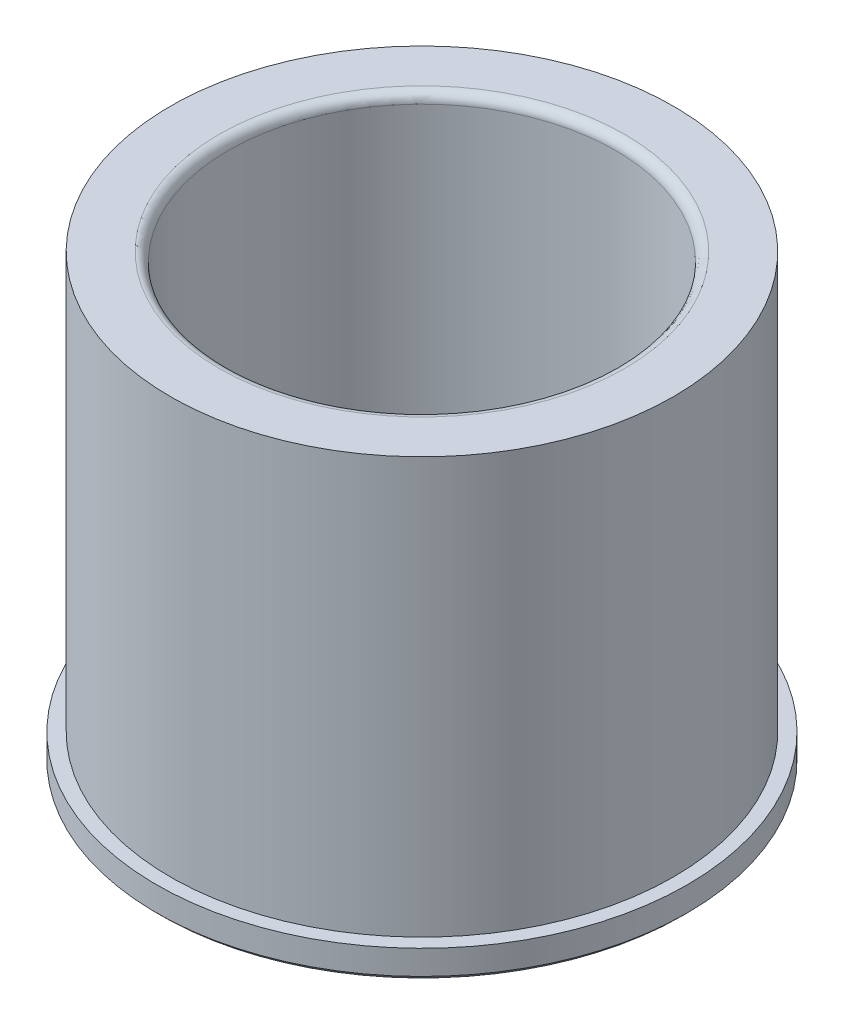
from build123d import *

# Parameters (mm, degrees)
FILLET1_R = 1.524


with BuildPart() as part:
    # Sketch1 → Revolve1 (revolve)
    with BuildSketch(Plane.XY, mode=Mode.PRIVATE) as revolve1_sk:
        Polygon((-42.7609, 0), (-43.5229, 0.762), (-43.5229, 4.7625), (-41.28135, 4.7625), (-41.28135, 73.025), (-31.75635, 73.025), (-31.75635, 0.762), (-32.51835, 0), align=None)
    revolve(revolve1_sk.sketch.rotate(Axis((0, -1000, 0), (0, 1, 0)), 180), axis=Axis((0, -1000, 0), (0, 1, 0)))

    # Fillet1
    fillet1_edges = [part.edges().sort_by_distance(p)[0] for p in [
        (-31.75635, 73.025, 0),
    ]]
    fillet(fillet1_edges, radius=FILLET1_R)


solid = part.part
